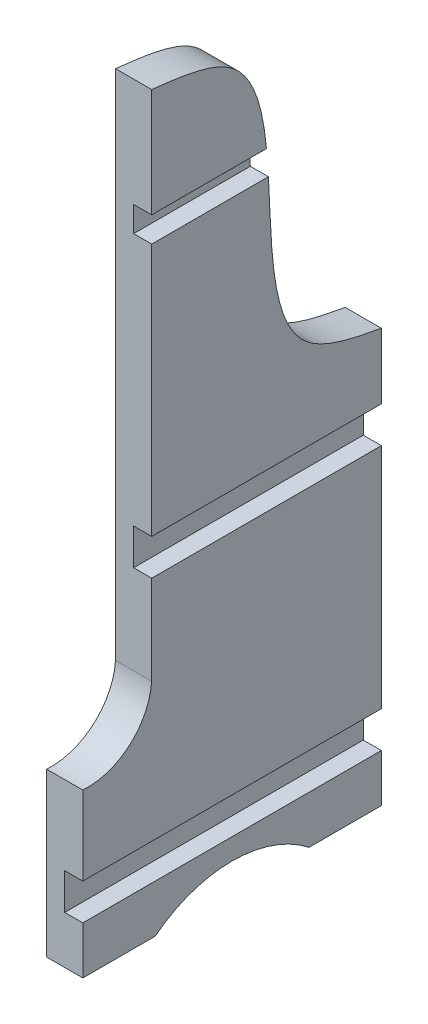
from build123d import *

# Parameters (mm, degrees)
EXTRUDE1_DEPTH     = 10
CUT_EXTRUDE1_START = 10
SKETCH2_W          = 32.782625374
SKETCH2_H          = 7
CUT_EXTRUDE1_DEPTH = 5
CUT_EXTRUDE3_START = 10
SKETCH3_W          = 63.684742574
SKETCH3_H          = 10
CUT_EXTRUDE3_DEPTH = 5
CUT_EXTRUDE4_START = 10
SKETCH4_W          = 83.265898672
SKETCH4_H          = 10
CUT_EXTRUDE4_DEPTH = 5


with BuildPart() as part:
    # Sketch1 → Extrude1 (new body)
    with BuildSketch(Plane(origin=(0, 0, 0), x_dir=(0, 0, -1), z_dir=(1, 0, 0))):
        with BuildLine():
            Line((-51.940954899, 0), (-31.940954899, 0))
            ThreePointArc((-31.940954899, 0), (-10.665954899, 7.37309837), (10.609045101, 0))
            Line((10.609045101, 0), (30.609045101, 0))
            Line((30.609045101, 0), (30.609045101, 114.299997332))
            add(Edge.make_bspline(
                [(-32.890954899, 203.2), (-24.789360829, 202.284365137), (12.398409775, 198.081436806), (-12.725636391, 122.379582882), (23.136829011, 115.693163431), (30.609045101, 114.299997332)],
                knots=[0, 0, 0, 0, 0.180665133, 0.829285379, 1, 1, 1, 1], degree=3))
            Line((-32.890954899, 203.2), (-32.890954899, 61.49789055))
            ThreePointArc((-32.890954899, 61.49789055), (-38.999129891, 49.303561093), (-51.940954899, 45))
            Line((-51.940954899, 45), (-51.940954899, 0))
        make_face()
    extrude(amount=EXTRUDE1_DEPTH)

    # Sketch2 → Cut-Extrude1 (cut)
    with BuildSketch(Plane(origin=(0, 0, 0), x_dir=(0, 0, -1), z_dir=(1, 0, 0)).offset(CUT_EXTRUDE1_START)):
        with Locations((-17.013724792, 169.7)):
            Rectangle(SKETCH2_W, SKETCH2_H)
    extrude(amount=-CUT_EXTRUDE1_DEPTH, mode=Mode.SUBTRACT)

    # Sketch3 → Cut-Extrude3 (cut)
    with BuildSketch(Plane(origin=(0, 0, 0), x_dir=(0, 0, -1), z_dir=(1, 0, 0)).offset(CUT_EXTRUDE3_START)):
        with Locations((-1.233326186, 91.2)):
            Rectangle(SKETCH3_W, SKETCH3_H)
    extrude(amount=-CUT_EXTRUDE3_DEPTH, mode=Mode.SUBTRACT)

    # Sketch4 → Cut-Extrude4 (cut)
    with BuildSketch(Plane(origin=(0, 0, 0), x_dir=(0, 0, -1), z_dir=(1, 0, 0)).offset(CUT_EXTRUDE4_START)):
        with Locations((-10.718921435, 18.2)):
            Rectangle(SKETCH4_W, SKETCH4_H)
    extrude(amount=-CUT_EXTRUDE4_DEPTH, mode=Mode.SUBTRACT)


solid = part.part
